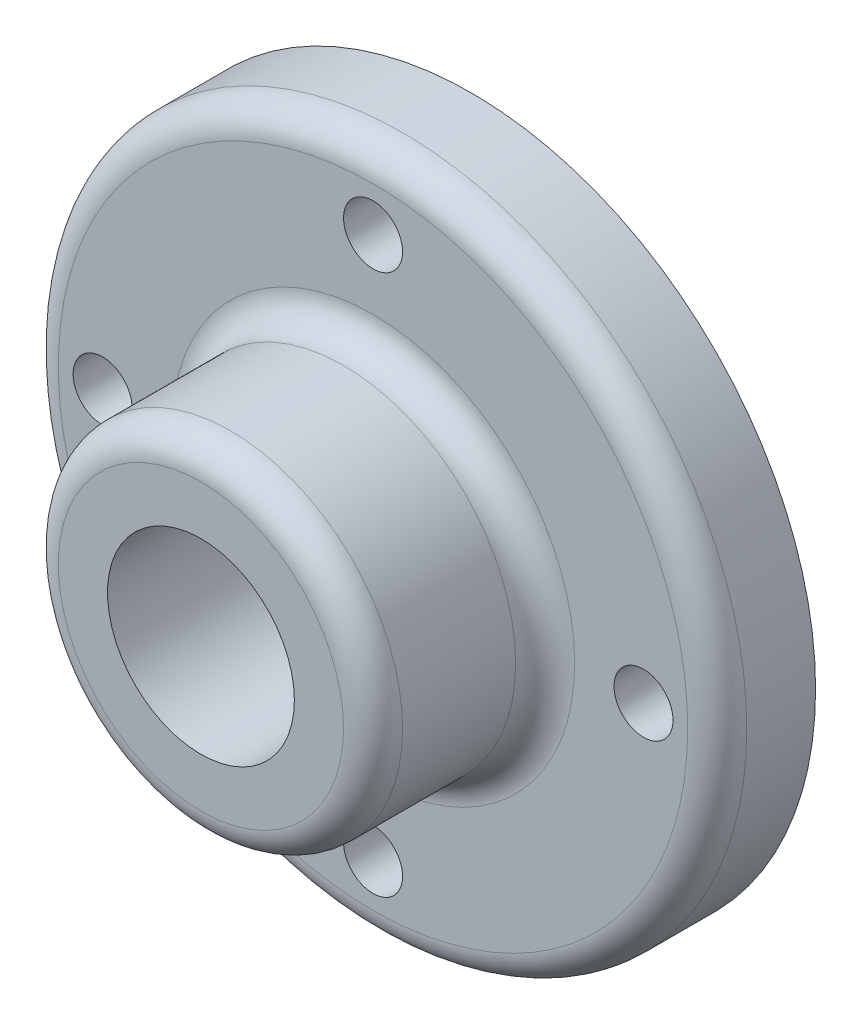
from build123d import *

# Parameters (mm, degrees)
F_12_0_12_DIAMETER_HOLE1_D = 12


with BuildPart() as part:
    # Sketch1 → Revolve1 (revolve)
    with BuildSketch(Plane(origin=(0, 0, 0), x_dir=(1, 0, 0), z_dir=(0, 1, 0))):
        with BuildLine():
            Line((19, 0), (19, 55))
            Line((19, 55), (70, 55))
            Line((70, 55), (70, 41))
            ThreePointArc((70, 41), (68.242640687, 36.757359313), (64, 35))
            Line((64, 35), (41, 35))
            ThreePointArc((41, 35), (36.757359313, 33.242640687), (35, 29))
            Line((35, 29), (35, 6))
            ThreePointArc((35, 6), (33.242640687, 1.757359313), (29, 0))
            Line((29, 0), (19, 0))
        make_face()
    revolve(axis=Axis((0, 0, 0), (0, 0, -1)))

    # 12.0 _12_ Diameter Hole1 (through all)
    with Locations(Plane.XY.offset(-35)):
        with Locations((0, 55), (55, 0), (0, -55), (-55, 0)):
            Hole(F_12_0_12_DIAMETER_HOLE1_D / 2)


solid = part.part
